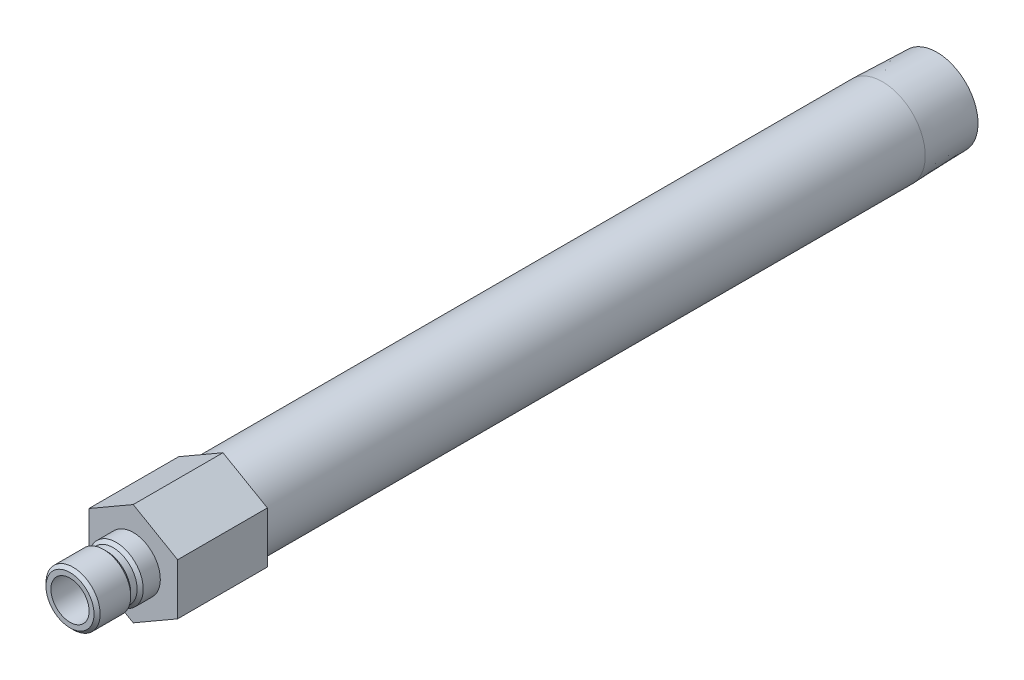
ISO-10303-21;
HEADER;
FILE_DESCRIPTION(('STEP AP214'),'2;1');
FILE_NAME('part.step','',(''),(''),'','','');
FILE_SCHEMA(('AUTOMOTIVE_DESIGN { 1 0 10303 214 1 1 1 1 }'));
ENDSEC;
DATA;
#1=APPLICATION_CONTEXT('core data for automotive mechanical design processes');
#2=APPLICATION_PROTOCOL_DEFINITION('international standard','automotive_design',2000,#1);
#3=PRODUCT_CONTEXT('',#1,'mechanical');
#4=PRODUCT('Part','Part','',(#3));
#5=PRODUCT_RELATED_PRODUCT_CATEGORY('part','',(#4));
#6=PRODUCT_DEFINITION_FORMATION('','',#4);
#7=PRODUCT_DEFINITION_CONTEXT('part definition',#1,'design');
#8=PRODUCT_DEFINITION('design','',#6,#7);
#9=PRODUCT_DEFINITION_SHAPE('','',#8);
#10=(LENGTH_UNIT() NAMED_UNIT(*) SI_UNIT(.MILLI.,.METRE.));
#11=(NAMED_UNIT(*) PLANE_ANGLE_UNIT() SI_UNIT($,.RADIAN.));
#12=(NAMED_UNIT(*) SI_UNIT($,.STERADIAN.) SOLID_ANGLE_UNIT());
#13=UNCERTAINTY_MEASURE_WITH_UNIT(LENGTH_MEASURE(1.E-05),#10,'distance_accuracy_value','');
#14=(GEOMETRIC_REPRESENTATION_CONTEXT(3) GLOBAL_UNCERTAINTY_ASSIGNED_CONTEXT((#13)) GLOBAL_UNIT_ASSIGNED_CONTEXT((#10,
#11,#12)) REPRESENTATION_CONTEXT('',''));
#15=CARTESIAN_POINT('',(0.,0.,0.));
#16=DIRECTION('',(0.,0.,1.));
#17=DIRECTION('',(1.,0.,0.));
#18=AXIS2_PLACEMENT_3D('',#15,#16,#17);
#19=CARTESIAN_POINT('',(0.,0.,0.));
#20=DIRECTION('',(0.,0.,-1.));
#21=DIRECTION('',(0.,1.,0.));
#22=AXIS2_PLACEMENT_3D('',#19,#20,#21);
#23=CYLINDRICAL_SURFACE('',#22,10.668);
#24=CARTESIAN_POINT('',(0.,0.,-186.5884));
#25=DIRECTION('',(0.,0.,-1.));
#26=DIRECTION('',(0.,1.,0.));
#27=AXIS2_PLACEMENT_3D('',#24,#25,#26);
#28=CIRCLE('',#27,10.668);
#29=CARTESIAN_POINT('',(0.,10.668,-186.5884));
#30=VERTEX_POINT('',#29);
#31=EDGE_CURVE('E168',#30,#30,#28,.T.);
#32=ORIENTED_EDGE('',*,*,#31,.F.);
#33=EDGE_LOOP('',(#32));
#34=FACE_BOUND('',#33,.T.);
#35=CARTESIAN_POINT('',(0.,0.,-22.352));
#36=DIRECTION('',(0.,0.,1.));
#37=DIRECTION('',(1.,0.,0.));
#38=AXIS2_PLACEMENT_3D('',#35,#36,#37);
#39=CIRCLE('',#38,10.668);
#40=CARTESIAN_POINT('',(10.668,0.,-22.352));
#41=VERTEX_POINT('',#40);
#42=EDGE_CURVE('E37',#41,#41,#39,.F.);
#43=ORIENTED_EDGE('',*,*,#42,.T.);
#44=EDGE_LOOP('',(#43));
#45=FACE_BOUND('',#44,.T.);
#46=ADVANCED_FACE('F33',(#34,#45),#23,.T.);
#47=CARTESIAN_POINT('',(0.,0.,0.));
#48=DIRECTION('',(0.,0.,-1.));
#49=DIRECTION('',(0.,1.,0.));
#50=AXIS2_PLACEMENT_3D('',#47,#48,#49);
#51=CYLINDRICAL_SURFACE('',#50,4.76249999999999);
#52=CARTESIAN_POINT('',(0.,0.,15.748));
#53=DIRECTION('',(0.,0.,-1.));
#54=DIRECTION('',(0.,1.,0.));
#55=AXIS2_PLACEMENT_3D('',#52,#53,#54);
#56=CIRCLE('',#55,4.7625);
#57=CARTESIAN_POINT('',(0.,4.7625,15.748));
#58=VERTEX_POINT('',#57);
#59=EDGE_CURVE('E144',#58,#58,#56,.T.);
#60=ORIENTED_EDGE('',*,*,#59,.F.);
#61=EDGE_LOOP('',(#60));
#62=FACE_BOUND('',#61,.T.);
#63=CARTESIAN_POINT('',(0.,0.,-22.352));
#64=DIRECTION('',(0.,0.,-1.));
#65=DIRECTION('',(0.,1.,0.));
#66=AXIS2_PLACEMENT_3D('',#63,#64,#65);
#67=CIRCLE('',#66,4.76249999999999);
#68=CARTESIAN_POINT('',(0.,4.7625,-22.352));
#69=VERTEX_POINT('',#68);
#70=EDGE_CURVE('E11',#69,#69,#67,.T.);
#71=ORIENTED_EDGE('',*,*,#70,.T.);
#72=EDGE_LOOP('',(#71));
#73=FACE_BOUND('',#72,.T.);
#74=ADVANCED_FACE('F35',(#62,#73),#51,.F.);
#75=CARTESIAN_POINT('',(0.,4.7625,-22.352));
#76=DIRECTION('',(0.,0.,-1.));
#77=DIRECTION('',(0.,1.,0.));
#78=AXIS2_PLACEMENT_3D('',#75,#76,#77);
#79=PLANE('',#78);
#80=CARTESIAN_POINT('',(0.,0.,-22.352));
#81=DIRECTION('',(0.,0.,-1.));
#82=DIRECTION('',(0.,1.,0.));
#83=AXIS2_PLACEMENT_3D('',#80,#81,#82);
#84=CIRCLE('',#83,7.89939999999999);
#85=CARTESIAN_POINT('',(0.,7.8994,-22.352));
#86=VERTEX_POINT('',#85);
#87=EDGE_CURVE('E43',#86,#86,#84,.T.);
#88=ORIENTED_EDGE('',*,*,#87,.T.);
#89=EDGE_LOOP('',(#88));
#90=FACE_BOUND('',#89,.T.);
#91=ORIENTED_EDGE('',*,*,#70,.F.);
#92=EDGE_LOOP('',(#91));
#93=FACE_BOUND('',#92,.T.);
#94=ADVANCED_FACE('F180',(#90,#93),#79,.T.);
#95=CARTESIAN_POINT('',(0.,0.,0.));
#96=DIRECTION('',(0.,0.,-1.));
#97=DIRECTION('',(0.,1.,0.));
#98=AXIS2_PLACEMENT_3D('',#95,#96,#97);
#99=CYLINDRICAL_SURFACE('',#98,7.89939999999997);
#100=CARTESIAN_POINT('',(0.,0.,-200.152));
#101=DIRECTION('',(0.,0.,-1.));
#102=DIRECTION('',(0.,1.,0.));
#103=AXIS2_PLACEMENT_3D('',#100,#101,#102);
#104=CIRCLE('',#103,7.89939999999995);
#105=CARTESIAN_POINT('',(0.,7.8994,-200.152));
#106=VERTEX_POINT('',#105);
#107=EDGE_CURVE('E174',#106,#106,#104,.T.);
#108=ORIENTED_EDGE('',*,*,#107,.T.);
#109=EDGE_LOOP('',(#108));
#110=FACE_BOUND('',#109,.T.);
#111=ORIENTED_EDGE('',*,*,#87,.F.);
#112=EDGE_LOOP('',(#111));
#113=FACE_BOUND('',#112,.T.);
#114=ADVANCED_FACE('F183',(#110,#113),#99,.F.);
#115=CARTESIAN_POINT('',(0.,10.244140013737,-200.152));
#116=DIRECTION('',(0.,0.,-1.));
#117=DIRECTION('',(0.,1.,0.));
#118=AXIS2_PLACEMENT_3D('',#115,#116,#117);
#119=PLANE('',#118);
#120=CARTESIAN_POINT('',(0.,0.,-200.152));
#121=DIRECTION('',(0.,0.,-1.));
#122=DIRECTION('',(0.,1.,0.));
#123=AXIS2_PLACEMENT_3D('',#120,#121,#122);
#124=CIRCLE('',#123,10.2441400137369);
#125=CARTESIAN_POINT('',(0.,10.244140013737,-200.152));
#126=VERTEX_POINT('',#125);
#127=EDGE_CURVE('E171',#126,#126,#124,.T.);
#128=ORIENTED_EDGE('',*,*,#127,.T.);
#129=EDGE_LOOP('',(#128));
#130=FACE_BOUND('',#129,.T.);
#131=ORIENTED_EDGE('',*,*,#107,.F.);
#132=EDGE_LOOP('',(#131));
#133=FACE_BOUND('',#132,.T.);
#134=ADVANCED_FACE('F185',(#130,#133),#119,.T.);
#135=CARTESIAN_POINT('',(0.,0.,-200.152));
#136=DIRECTION('',(0.,0.,1.));
#137=DIRECTION('',(0.,-1.,0.));
#138=AXIS2_PLACEMENT_3D('',#135,#136,#137);
#139=CONICAL_SURFACE('',#138,10.2441400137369,0.0312396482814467);
#140=ORIENTED_EDGE('',*,*,#31,.T.);
#141=EDGE_LOOP('',(#140));
#142=FACE_BOUND('',#141,.T.);
#143=ORIENTED_EDGE('',*,*,#127,.F.);
#144=EDGE_LOOP('',(#143));
#145=FACE_BOUND('',#144,.T.);
#146=ADVANCED_FACE('F192',(#142,#145),#139,.T.);
#147=CARTESIAN_POINT('',(0.,6.7437,0.));
#148=DIRECTION('',(0.,0.,1.));
#149=DIRECTION('',(0.,-1.,0.));
#150=AXIS2_PLACEMENT_3D('',#147,#148,#149);
#151=PLANE('',#150);
#152=CARTESIAN_POINT('',(0.,0.,0.));
#153=DIRECTION('',(0.,0.,-1.));
#154=DIRECTION('',(0.,1.,0.));
#155=AXIS2_PLACEMENT_3D('',#152,#153,#154);
#156=CIRCLE('',#155,6.7437);
#157=CARTESIAN_POINT('',(0.,6.7437,0.));
#158=VERTEX_POINT('',#157);
#159=EDGE_CURVE('E165',#158,#158,#156,.T.);
#160=ORIENTED_EDGE('',*,*,#159,.T.);
#161=EDGE_LOOP('',(#160));
#162=FACE_BOUND('',#161,.T.);
#163=DIRECTION('',(-0.866025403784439,-0.5,0.));
#164=VECTOR('',#163,1.);
#165=CARTESIAN_POINT('',(0.,12.7582862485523,0.));
#166=LINE('',#165,#164);
#167=CARTESIAN_POINT('',(0.,12.7582862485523,0.));
#168=VERTEX_POINT('',#167);
#169=CARTESIAN_POINT('',(-11.049,6.37914312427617,0.));
#170=VERTEX_POINT('',#169);
#171=EDGE_CURVE('E122',#168,#170,#166,.T.);
#172=ORIENTED_EDGE('',*,*,#171,.T.);
#173=DIRECTION('',(0.,-1.,0.));
#174=VECTOR('',#173,1.);
#175=CARTESIAN_POINT('',(-11.049,6.37914312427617,0.));
#176=LINE('',#175,#174);
#177=CARTESIAN_POINT('',(-11.049,-6.37914312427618,0.));
#178=VERTEX_POINT('',#177);
#179=EDGE_CURVE('E125',#170,#178,#176,.T.);
#180=ORIENTED_EDGE('',*,*,#179,.T.);
#181=DIRECTION('',(0.866025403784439,-0.5,0.));
#182=VECTOR('',#181,1.);
#183=CARTESIAN_POINT('',(-11.049,-6.37914312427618,0.));
#184=LINE('',#183,#182);
#185=CARTESIAN_POINT('',(0.,-12.7582862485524,0.));
#186=VERTEX_POINT('',#185);
#187=EDGE_CURVE('E128',#178,#186,#184,.T.);
#188=ORIENTED_EDGE('',*,*,#187,.T.);
#189=DIRECTION('',(0.866025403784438,0.5,0.));
#190=VECTOR('',#189,1.);
#191=CARTESIAN_POINT('',(0.,-12.7582862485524,0.));
#192=LINE('',#191,#190);
#193=CARTESIAN_POINT('',(11.049,-6.37914312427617,0.));
#194=VERTEX_POINT('',#193);
#195=EDGE_CURVE('E131',#186,#194,#192,.T.);
#196=ORIENTED_EDGE('',*,*,#195,.T.);
#197=DIRECTION('',(0.,1.,0.));
#198=VECTOR('',#197,1.);
#199=CARTESIAN_POINT('',(11.049,-6.37914312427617,0.));
#200=LINE('',#199,#198);
#201=CARTESIAN_POINT('',(11.049,6.37914312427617,0.));
#202=VERTEX_POINT('',#201);
#203=EDGE_CURVE('E99',#194,#202,#200,.T.);
#204=ORIENTED_EDGE('',*,*,#203,.T.);
#205=DIRECTION('',(-0.866025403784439,0.5,0.));
#206=VECTOR('',#205,1.);
#207=CARTESIAN_POINT('',(11.049,6.37914312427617,0.));
#208=LINE('',#207,#206);
#209=EDGE_CURVE('E134',#202,#168,#208,.T.);
#210=ORIENTED_EDGE('',*,*,#209,.T.);
#211=EDGE_LOOP('',(#172,#180,#188,#196,#204,#210));
#212=FACE_BOUND('',#211,.T.);
#213=ADVANCED_FACE('F206',(#162,#212),#151,.T.);
#214=CARTESIAN_POINT('',(0.,0.,0.));
#215=DIRECTION('',(0.,0.,-1.));
#216=DIRECTION('',(0.,1.,0.));
#217=AXIS2_PLACEMENT_3D('',#214,#215,#216);
#218=CYLINDRICAL_SURFACE('',#217,6.7437);
#219=CARTESIAN_POINT('',(0.,0.,4.25449999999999));
#220=DIRECTION('',(0.,0.,-1.));
#221=DIRECTION('',(0.,1.,0.));
#222=AXIS2_PLACEMENT_3D('',#219,#220,#221);
#223=CIRCLE('',#222,6.7437);
#224=CARTESIAN_POINT('',(0.,6.7437,4.25449999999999));
#225=VERTEX_POINT('',#224);
#226=EDGE_CURVE('E162',#225,#225,#223,.T.);
#227=ORIENTED_EDGE('',*,*,#226,.T.);
#228=EDGE_LOOP('',(#227));
#229=FACE_BOUND('',#228,.T.);
#230=ORIENTED_EDGE('',*,*,#159,.F.);
#231=EDGE_LOOP('',(#230));
#232=FACE_BOUND('',#231,.T.);
#233=ADVANCED_FACE('F213',(#229,#232),#218,.T.);
#234=CARTESIAN_POINT('',(0.,0.,4.25449999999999));
#235=DIRECTION('',(0.,0.,-1.));
#236=DIRECTION('',(0.,1.,0.));
#237=AXIS2_PLACEMENT_3D('',#234,#235,#236);
#238=CONICAL_SURFACE('',#237,6.7437,0.785398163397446);
#239=CARTESIAN_POINT('',(0.,0.,5.0165));
#240=DIRECTION('',(0.,0.,-1.));
#241=DIRECTION('',(0.,1.,0.));
#242=AXIS2_PLACEMENT_3D('',#239,#240,#241);
#243=CIRCLE('',#242,5.9817);
#244=CARTESIAN_POINT('',(0.,5.9817,5.0165));
#245=VERTEX_POINT('',#244);
#246=EDGE_CURVE('E159',#245,#245,#243,.T.);
#247=ORIENTED_EDGE('',*,*,#246,.T.);
#248=EDGE_LOOP('',(#247));
#249=FACE_BOUND('',#248,.T.);
#250=ORIENTED_EDGE('',*,*,#226,.F.);
#251=EDGE_LOOP('',(#250));
#252=FACE_BOUND('',#251,.T.);
#253=ADVANCED_FACE('F222',(#249,#252),#238,.T.);
#254=CARTESIAN_POINT('',(0.,0.,0.));
#255=DIRECTION('',(0.,0.,-1.));
#256=DIRECTION('',(0.,1.,0.));
#257=AXIS2_PLACEMENT_3D('',#254,#255,#256);
#258=CYLINDRICAL_SURFACE('',#257,5.9817);
#259=CARTESIAN_POINT('',(0.,0.,6.604));
#260=DIRECTION('',(0.,0.,-1.));
#261=DIRECTION('',(0.,1.,0.));
#262=AXIS2_PLACEMENT_3D('',#259,#260,#261);
#263=CIRCLE('',#262,5.9817);
#264=CARTESIAN_POINT('',(0.,5.9817,6.604));
#265=VERTEX_POINT('',#264);
#266=EDGE_CURVE('E156',#265,#265,#263,.T.);
#267=ORIENTED_EDGE('',*,*,#266,.T.);
#268=EDGE_LOOP('',(#267));
#269=FACE_BOUND('',#268,.T.);
#270=ORIENTED_EDGE('',*,*,#246,.F.);
#271=EDGE_LOOP('',(#270));
#272=FACE_BOUND('',#271,.T.);
#273=ADVANCED_FACE('F263',(#269,#272),#258,.T.);
#274=CARTESIAN_POINT('',(0.,0.,6.604));
#275=DIRECTION('',(0.,0.,1.));
#276=DIRECTION('',(0.,-1.,0.));
#277=AXIS2_PLACEMENT_3D('',#274,#275,#276);
#278=CONICAL_SURFACE('',#277,5.9817,0.785398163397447);
#279=CARTESIAN_POINT('',(0.,0.,7.366));
#280=DIRECTION('',(0.,0.,-1.));
#281=DIRECTION('',(0.,1.,0.));
#282=AXIS2_PLACEMENT_3D('',#279,#280,#281);
#283=CIRCLE('',#282,6.7437);
#284=CARTESIAN_POINT('',(0.,6.7437,7.366));
#285=VERTEX_POINT('',#284);
#286=EDGE_CURVE('E153',#285,#285,#283,.T.);
#287=ORIENTED_EDGE('',*,*,#286,.T.);
#288=EDGE_LOOP('',(#287));
#289=FACE_BOUND('',#288,.T.);
#290=ORIENTED_EDGE('',*,*,#266,.F.);
#291=EDGE_LOOP('',(#290));
#292=FACE_BOUND('',#291,.T.);
#293=ADVANCED_FACE('F259',(#289,#292),#278,.T.);
#294=CARTESIAN_POINT('',(0.,0.,0.));
#295=DIRECTION('',(0.,0.,-1.));
#296=DIRECTION('',(0.,1.,0.));
#297=AXIS2_PLACEMENT_3D('',#294,#295,#296);
#298=CYLINDRICAL_SURFACE('',#297,6.7437);
#299=CARTESIAN_POINT('',(0.,0.,14.986));
#300=DIRECTION('',(0.,0.,-1.));
#301=DIRECTION('',(0.,1.,0.));
#302=AXIS2_PLACEMENT_3D('',#299,#300,#301);
#303=CIRCLE('',#302,6.7437);
#304=CARTESIAN_POINT('',(0.,6.7437,14.986));
#305=VERTEX_POINT('',#304);
#306=EDGE_CURVE('E150',#305,#305,#303,.T.);
#307=ORIENTED_EDGE('',*,*,#306,.T.);
#308=EDGE_LOOP('',(#307));
#309=FACE_BOUND('',#308,.T.);
#310=ORIENTED_EDGE('',*,*,#286,.F.);
#311=EDGE_LOOP('',(#310));
#312=FACE_BOUND('',#311,.T.);
#313=ADVANCED_FACE('F255',(#309,#312),#298,.T.);
#314=CARTESIAN_POINT('',(0.,0.,14.986));
#315=DIRECTION('',(0.,0.,-1.));
#316=DIRECTION('',(0.,1.,0.));
#317=AXIS2_PLACEMENT_3D('',#314,#315,#316);
#318=CONICAL_SURFACE('',#317,6.7437,0.785398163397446);
#319=CARTESIAN_POINT('',(0.,0.,15.748));
#320=DIRECTION('',(0.,0.,-1.));
#321=DIRECTION('',(0.,1.,0.));
#322=AXIS2_PLACEMENT_3D('',#319,#320,#321);
#323=CIRCLE('',#322,5.9817);
#324=CARTESIAN_POINT('',(0.,5.9817,15.748));
#325=VERTEX_POINT('',#324);
#326=EDGE_CURVE('E147',#325,#325,#323,.T.);
#327=ORIENTED_EDGE('',*,*,#326,.T.);
#328=EDGE_LOOP('',(#327));
#329=FACE_BOUND('',#328,.T.);
#330=ORIENTED_EDGE('',*,*,#306,.F.);
#331=EDGE_LOOP('',(#330));
#332=FACE_BOUND('',#331,.T.);
#333=ADVANCED_FACE('F251',(#329,#332),#318,.T.);
#334=CARTESIAN_POINT('',(0.,4.7625,15.748));
#335=DIRECTION('',(0.,0.,1.));
#336=DIRECTION('',(0.,-1.,0.));
#337=AXIS2_PLACEMENT_3D('',#334,#335,#336);
#338=PLANE('',#337);
#339=ORIENTED_EDGE('',*,*,#59,.T.);
#340=EDGE_LOOP('',(#339));
#341=FACE_BOUND('',#340,.T.);
#342=ORIENTED_EDGE('',*,*,#326,.F.);
#343=EDGE_LOOP('',(#342));
#344=FACE_BOUND('',#343,.T.);
#345=ADVANCED_FACE('F239',(#341,#344),#338,.T.);
#346=CARTESIAN_POINT('',(0.,12.7582862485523,-22.352));
#347=DIRECTION('',(-0.5,0.866025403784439,0.));
#348=DIRECTION('',(-0.866025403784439,-0.5,0.));
#349=AXIS2_PLACEMENT_3D('',#346,#347,#348);
#350=PLANE('',#349);
#351=ORIENTED_EDGE('',*,*,#171,.F.);
#352=DIRECTION('',(0.,0.,1.));
#353=VECTOR('',#352,1.);
#354=CARTESIAN_POINT('',(0.,12.7582862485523,-22.352));
#355=LINE('',#354,#353);
#356=CARTESIAN_POINT('',(0.,12.7582862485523,-22.352));
#357=VERTEX_POINT('',#356);
#358=EDGE_CURVE('E51',#357,#168,#355,.T.);
#359=ORIENTED_EDGE('',*,*,#358,.F.);
#360=DIRECTION('',(-0.866025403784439,-0.5,0.));
#361=VECTOR('',#360,1.);
#362=CARTESIAN_POINT('',(0.,12.7582862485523,-22.352));
#363=LINE('',#362,#361);
#364=CARTESIAN_POINT('',(-11.049,6.37914312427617,-22.352));
#365=VERTEX_POINT('',#364);
#366=EDGE_CURVE('E137',#357,#365,#363,.T.);
#367=ORIENTED_EDGE('',*,*,#366,.T.);
#368=DIRECTION('',(0.,0.,1.));
#369=VECTOR('',#368,1.);
#370=CARTESIAN_POINT('',(-11.049,6.37914312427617,-22.352));
#371=LINE('',#370,#369);
#372=EDGE_CURVE('E86',#365,#170,#371,.T.);
#373=ORIENTED_EDGE('',*,*,#372,.T.);
#374=EDGE_LOOP('',(#351,#359,#367,#373));
#375=FACE_BOUND('',#374,.T.);
#376=ADVANCED_FACE('F226',(#375),#350,.T.);
#377=CARTESIAN_POINT('',(11.049,6.37914312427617,-22.352));
#378=DIRECTION('',(0.5,0.866025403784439,0.));
#379=DIRECTION('',(-0.866025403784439,0.5,0.));
#380=AXIS2_PLACEMENT_3D('',#377,#378,#379);
#381=PLANE('',#380);
#382=ORIENTED_EDGE('',*,*,#209,.F.);
#383=DIRECTION('',(0.,0.,1.));
#384=VECTOR('',#383,1.);
#385=CARTESIAN_POINT('',(11.049,6.37914312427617,-22.352));
#386=LINE('',#385,#384);
#387=CARTESIAN_POINT('',(11.049,6.37914312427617,-22.352));
#388=VERTEX_POINT('',#387);
#389=EDGE_CURVE('E74',#388,#202,#386,.T.);
#390=ORIENTED_EDGE('',*,*,#389,.F.);
#391=DIRECTION('',(-0.866025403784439,0.5,0.));
#392=VECTOR('',#391,1.);
#393=CARTESIAN_POINT('',(11.049,6.37914312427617,-22.352));
#394=LINE('',#393,#392);
#395=EDGE_CURVE('E112',#388,#357,#394,.T.);
#396=ORIENTED_EDGE('',*,*,#395,.T.);
#397=ORIENTED_EDGE('',*,*,#358,.T.);
#398=EDGE_LOOP('',(#382,#390,#396,#397));
#399=FACE_BOUND('',#398,.T.);
#400=ADVANCED_FACE('F231',(#399),#381,.T.);
#401=CARTESIAN_POINT('',(11.049,-6.37914312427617,-22.352));
#402=DIRECTION('',(1.,0.,0.));
#403=DIRECTION('',(0.,0.,-1.));
#404=AXIS2_PLACEMENT_3D('',#401,#402,#403);
#405=PLANE('',#404);
#406=ORIENTED_EDGE('',*,*,#203,.F.);
#407=DIRECTION('',(0.,0.,1.));
#408=VECTOR('',#407,1.);
#409=CARTESIAN_POINT('',(11.049,-6.37914312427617,-22.352));
#410=LINE('',#409,#408);
#411=CARTESIAN_POINT('',(11.049,-6.37914312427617,-22.352));
#412=VERTEX_POINT('',#411);
#413=EDGE_CURVE('E94',#412,#194,#410,.T.);
#414=ORIENTED_EDGE('',*,*,#413,.F.);
#415=DIRECTION('',(0.,1.,0.));
#416=VECTOR('',#415,1.);
#417=CARTESIAN_POINT('',(11.049,-6.37914312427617,-22.352));
#418=LINE('',#417,#416);
#419=EDGE_CURVE('E97',#412,#388,#418,.T.);
#420=ORIENTED_EDGE('',*,*,#419,.T.);
#421=ORIENTED_EDGE('',*,*,#389,.T.);
#422=EDGE_LOOP('',(#406,#414,#420,#421));
#423=FACE_BOUND('',#422,.T.);
#424=ADVANCED_FACE('F96',(#423),#405,.T.);
#425=CARTESIAN_POINT('',(0.,-12.7582862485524,-22.352));
#426=DIRECTION('',(0.5,-0.866025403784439,0.));
#427=DIRECTION('',(0.866025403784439,0.5,0.));
#428=AXIS2_PLACEMENT_3D('',#425,#426,#427);
#429=PLANE('',#428);
#430=ORIENTED_EDGE('',*,*,#195,.F.);
#431=DIRECTION('',(0.,0.,1.));
#432=VECTOR('',#431,1.);
#433=CARTESIAN_POINT('',(0.,-12.7582862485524,-22.352));
#434=LINE('',#433,#432);
#435=CARTESIAN_POINT('',(0.,-12.7582862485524,-22.352));
#436=VERTEX_POINT('',#435);
#437=EDGE_CURVE('E104',#436,#186,#434,.T.);
#438=ORIENTED_EDGE('',*,*,#437,.F.);
#439=DIRECTION('',(0.866025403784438,0.5,0.));
#440=VECTOR('',#439,1.);
#441=CARTESIAN_POINT('',(0.,-12.7582862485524,-22.352));
#442=LINE('',#441,#440);
#443=EDGE_CURVE('E110',#436,#412,#442,.T.);
#444=ORIENTED_EDGE('',*,*,#443,.T.);
#445=ORIENTED_EDGE('',*,*,#413,.T.);
#446=EDGE_LOOP('',(#430,#438,#444,#445));
#447=FACE_BOUND('',#446,.T.);
#448=ADVANCED_FACE('F114',(#447),#429,.T.);
#449=CARTESIAN_POINT('',(-11.049,-6.37914312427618,-22.352));
#450=DIRECTION('',(-0.5,-0.866025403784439,0.));
#451=DIRECTION('',(0.866025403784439,-0.5,0.));
#452=AXIS2_PLACEMENT_3D('',#449,#450,#451);
#453=PLANE('',#452);
#454=ORIENTED_EDGE('',*,*,#187,.F.);
#455=DIRECTION('',(0.,0.,1.));
#456=VECTOR('',#455,1.);
#457=CARTESIAN_POINT('',(-11.049,-6.37914312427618,-22.352));
#458=LINE('',#457,#456);
#459=CARTESIAN_POINT('',(-11.049,-6.37914312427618,-22.352));
#460=VERTEX_POINT('',#459);
#461=EDGE_CURVE('E141',#460,#178,#458,.T.);
#462=ORIENTED_EDGE('',*,*,#461,.F.);
#463=DIRECTION('',(0.866025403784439,-0.5,0.));
#464=VECTOR('',#463,1.);
#465=CARTESIAN_POINT('',(-11.049,-6.37914312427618,-22.352));
#466=LINE('',#465,#464);
#467=EDGE_CURVE('E115',#460,#436,#466,.T.);
#468=ORIENTED_EDGE('',*,*,#467,.T.);
#469=ORIENTED_EDGE('',*,*,#437,.T.);
#470=EDGE_LOOP('',(#454,#462,#468,#469));
#471=FACE_BOUND('',#470,.T.);
#472=ADVANCED_FACE('F230',(#471),#453,.T.);
#473=CARTESIAN_POINT('',(-11.049,6.37914312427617,-22.352));
#474=DIRECTION('',(-1.,0.,0.));
#475=DIRECTION('',(0.,0.,1.));
#476=AXIS2_PLACEMENT_3D('',#473,#474,#475);
#477=PLANE('',#476);
#478=ORIENTED_EDGE('',*,*,#179,.F.);
#479=ORIENTED_EDGE('',*,*,#372,.F.);
#480=DIRECTION('',(0.,-1.,0.));
#481=VECTOR('',#480,1.);
#482=CARTESIAN_POINT('',(-11.049,6.37914312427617,-22.352));
#483=LINE('',#482,#481);
#484=EDGE_CURVE('E117',#365,#460,#483,.T.);
#485=ORIENTED_EDGE('',*,*,#484,.T.);
#486=ORIENTED_EDGE('',*,*,#461,.T.);
#487=EDGE_LOOP('',(#478,#479,#485,#486));
#488=FACE_BOUND('',#487,.T.);
#489=ADVANCED_FACE('F227',(#488),#477,.T.);
#490=CARTESIAN_POINT('',(-11.049,6.37914312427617,-22.352));
#491=DIRECTION('',(0.,0.,1.));
#492=DIRECTION('',(1.,0.,0.));
#493=AXIS2_PLACEMENT_3D('',#490,#491,#492);
#494=PLANE('',#493);
#495=ORIENTED_EDGE('',*,*,#42,.F.);
#496=EDGE_LOOP('',(#495));
#497=FACE_BOUND('',#496,.T.);
#498=ORIENTED_EDGE('',*,*,#366,.F.);
#499=ORIENTED_EDGE('',*,*,#395,.F.);
#500=ORIENTED_EDGE('',*,*,#419,.F.);
#501=ORIENTED_EDGE('',*,*,#443,.F.);
#502=ORIENTED_EDGE('',*,*,#467,.F.);
#503=ORIENTED_EDGE('',*,*,#484,.F.);
#504=EDGE_LOOP('',(#498,#499,#500,#501,#502,#503));
#505=FACE_BOUND('',#504,.T.);
#506=ADVANCED_FACE('F108',(#497,#505),#494,.F.);
#507=CLOSED_SHELL('',(#46,#74,#94,#114,#134,#146,#213,#233,#253,#273,#293,#313,#333,#345,#376,
#400,#424,#448,#472,#489,#506));
#508=MANIFOLD_SOLID_BREP('B2',#507);
#509=ADVANCED_BREP_SHAPE_REPRESENTATION('',(#18,#508),#14);
#510=SHAPE_DEFINITION_REPRESENTATION(#9,#509);
ENDSEC;
END-ISO-10303-21;
